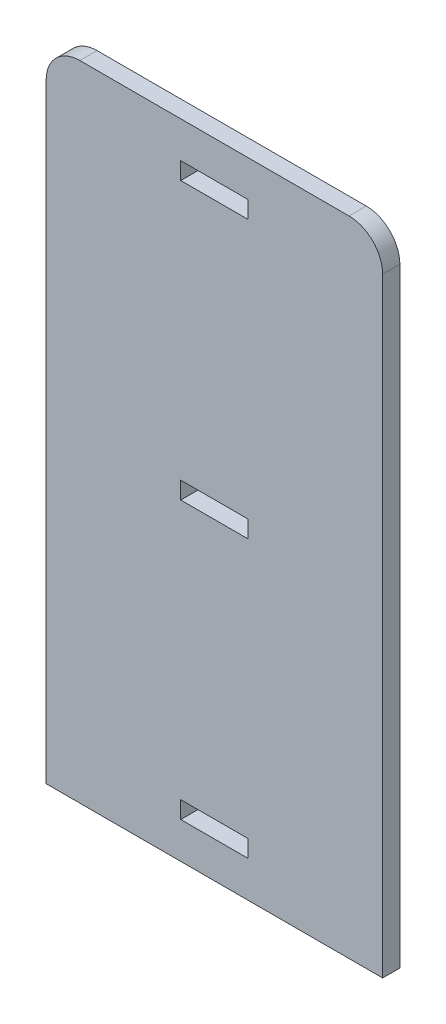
ISO-10303-21;
HEADER;
FILE_DESCRIPTION(('STEP AP214'),'2;1');
FILE_NAME('part.step','',(''),(''),'','','');
FILE_SCHEMA(('AUTOMOTIVE_DESIGN { 1 0 10303 214 1 1 1 1 }'));
ENDSEC;
DATA;
#1=APPLICATION_CONTEXT('core data for automotive mechanical design processes');
#2=APPLICATION_PROTOCOL_DEFINITION('international standard','automotive_design',2000,#1);
#3=PRODUCT_CONTEXT('',#1,'mechanical');
#4=PRODUCT('Part','Part','',(#3));
#5=PRODUCT_RELATED_PRODUCT_CATEGORY('part','',(#4));
#6=PRODUCT_DEFINITION_FORMATION('','',#4);
#7=PRODUCT_DEFINITION_CONTEXT('part definition',#1,'design');
#8=PRODUCT_DEFINITION('design','',#6,#7);
#9=PRODUCT_DEFINITION_SHAPE('','',#8);
#10=(LENGTH_UNIT() NAMED_UNIT(*) SI_UNIT(.MILLI.,.METRE.));
#11=(NAMED_UNIT(*) PLANE_ANGLE_UNIT() SI_UNIT($,.RADIAN.));
#12=(NAMED_UNIT(*) SI_UNIT($,.STERADIAN.) SOLID_ANGLE_UNIT());
#13=UNCERTAINTY_MEASURE_WITH_UNIT(LENGTH_MEASURE(1.E-05),#10,'distance_accuracy_value','');
#14=(GEOMETRIC_REPRESENTATION_CONTEXT(3) GLOBAL_UNCERTAINTY_ASSIGNED_CONTEXT((#13)) GLOBAL_UNIT_ASSIGNED_CONTEXT((#10,
#11,#12)) REPRESENTATION_CONTEXT('',''));
#15=CARTESIAN_POINT('',(0.,0.,0.));
#16=DIRECTION('',(0.,0.,1.));
#17=DIRECTION('',(1.,0.,0.));
#18=AXIS2_PLACEMENT_3D('',#15,#16,#17);
#19=CARTESIAN_POINT('',(0.,233.038781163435,23.));
#20=DIRECTION('',(0.,-1.,0.));
#21=DIRECTION('',(1.,0.,0.));
#22=AXIS2_PLACEMENT_3D('',#19,#20,#21);
#23=PLANE('',#22);
#24=DIRECTION('',(-1.,0.,0.));
#25=VECTOR('',#24,1.);
#26=CARTESIAN_POINT('',(0.,233.038781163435,0.));
#27=LINE('',#26,#25);
#28=CARTESIAN_POINT('',(180.417337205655,233.038781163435,0.));
#29=VERTEX_POINT('',#28);
#30=CARTESIAN_POINT('',(-179.582662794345,233.038781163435,0.));
#31=VERTEX_POINT('',#30);
#32=EDGE_CURVE('E222',#29,#31,#27,.T.);
#33=ORIENTED_EDGE('',*,*,#32,.T.);
#34=DIRECTION('',(0.,0.,-1.));
#35=VECTOR('',#34,1.);
#36=CARTESIAN_POINT('',(-179.582662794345,233.038781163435,23.));
#37=LINE('',#36,#35);
#38=CARTESIAN_POINT('',(-179.582662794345,233.038781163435,23.));
#39=VERTEX_POINT('',#38);
#40=EDGE_CURVE('E11',#39,#31,#37,.T.);
#41=ORIENTED_EDGE('',*,*,#40,.F.);
#42=DIRECTION('',(-1.,0.,0.));
#43=VECTOR('',#42,1.);
#44=CARTESIAN_POINT('',(0.,233.038781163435,23.));
#45=LINE('',#44,#43);
#46=CARTESIAN_POINT('',(180.417337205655,233.038781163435,23.));
#47=VERTEX_POINT('',#46);
#48=EDGE_CURVE('E312',#47,#39,#45,.T.);
#49=ORIENTED_EDGE('',*,*,#48,.F.);
#50=DIRECTION('',(0.,0.,-1.));
#51=VECTOR('',#50,1.);
#52=CARTESIAN_POINT('',(180.417337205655,233.038781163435,23.));
#53=LINE('',#52,#51);
#54=EDGE_CURVE('E233',#47,#29,#53,.T.);
#55=ORIENTED_EDGE('',*,*,#54,.T.);
#56=EDGE_LOOP('',(#33,#41,#49,#55));
#57=FACE_BOUND('',#56,.T.);
#58=ADVANCED_FACE('F34',(#57),#23,.F.);
#59=CARTESIAN_POINT('',(-179.582662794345,188.038781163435,23.));
#60=DIRECTION('',(0.,0.,-1.));
#61=DIRECTION('',(-1.,0.,0.));
#62=AXIS2_PLACEMENT_3D('',#59,#60,#61);
#63=CYLINDRICAL_SURFACE('',#62,45.);
#64=CARTESIAN_POINT('',(-179.582662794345,188.038781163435,0.));
#65=DIRECTION('',(0.,0.,1.));
#66=DIRECTION('',(1.,0.,0.));
#67=AXIS2_PLACEMENT_3D('',#64,#65,#66);
#68=CIRCLE('',#67,45.);
#69=CARTESIAN_POINT('',(-224.582662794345,188.038781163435,0.));
#70=VERTEX_POINT('',#69);
#71=EDGE_CURVE('E225',#31,#70,#68,.T.);
#72=ORIENTED_EDGE('',*,*,#71,.T.);
#73=DIRECTION('',(0.,0.,-1.));
#74=VECTOR('',#73,1.);
#75=CARTESIAN_POINT('',(-224.582662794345,188.038781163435,23.));
#76=LINE('',#75,#74);
#77=CARTESIAN_POINT('',(-224.582662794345,188.038781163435,23.));
#78=VERTEX_POINT('',#77);
#79=EDGE_CURVE('E44',#78,#70,#76,.T.);
#80=ORIENTED_EDGE('',*,*,#79,.F.);
#81=CARTESIAN_POINT('',(-179.582662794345,188.038781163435,23.));
#82=DIRECTION('',(0.,0.,1.));
#83=DIRECTION('',(1.,0.,0.));
#84=AXIS2_PLACEMENT_3D('',#81,#82,#83);
#85=CIRCLE('',#84,45.);
#86=EDGE_CURVE('E314',#39,#78,#85,.T.);
#87=ORIENTED_EDGE('',*,*,#86,.F.);
#88=ORIENTED_EDGE('',*,*,#40,.T.);
#89=EDGE_LOOP('',(#72,#80,#87,#88));
#90=FACE_BOUND('',#89,.T.);
#91=ADVANCED_FACE('F319',(#90),#63,.T.);
#92=CARTESIAN_POINT('',(-224.582662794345,0.,23.));
#93=DIRECTION('',(1.,0.,0.));
#94=DIRECTION('',(0.,1.,0.));
#95=AXIS2_PLACEMENT_3D('',#92,#93,#94);
#96=PLANE('',#95);
#97=DIRECTION('',(0.,-1.,0.));
#98=VECTOR('',#97,1.);
#99=CARTESIAN_POINT('',(-224.582662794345,0.,0.));
#100=LINE('',#99,#98);
#101=CARTESIAN_POINT('',(-224.582662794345,-626.961218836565,0.));
#102=VERTEX_POINT('',#101);
#103=EDGE_CURVE('E227',#70,#102,#100,.T.);
#104=ORIENTED_EDGE('',*,*,#103,.T.);
#105=DIRECTION('',(0.,0.,-1.));
#106=VECTOR('',#105,1.);
#107=CARTESIAN_POINT('',(-224.582662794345,-626.961218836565,23.));
#108=LINE('',#107,#106);
#109=CARTESIAN_POINT('',(-224.582662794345,-626.961218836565,23.));
#110=VERTEX_POINT('',#109);
#111=EDGE_CURVE('E186',#110,#102,#108,.T.);
#112=ORIENTED_EDGE('',*,*,#111,.F.);
#113=DIRECTION('',(0.,-1.,0.));
#114=VECTOR('',#113,1.);
#115=CARTESIAN_POINT('',(-224.582662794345,0.,23.));
#116=LINE('',#115,#114);
#117=EDGE_CURVE('E177',#78,#110,#116,.T.);
#118=ORIENTED_EDGE('',*,*,#117,.F.);
#119=ORIENTED_EDGE('',*,*,#79,.T.);
#120=EDGE_LOOP('',(#104,#112,#118,#119));
#121=FACE_BOUND('',#120,.T.);
#122=ADVANCED_FACE('F322',(#121),#96,.F.);
#123=CARTESIAN_POINT('',(0.,-626.961218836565,23.));
#124=DIRECTION('',(0.,1.,0.));
#125=DIRECTION('',(0.,0.,1.));
#126=AXIS2_PLACEMENT_3D('',#123,#124,#125);
#127=PLANE('',#126);
#128=DIRECTION('',(1.,0.,0.));
#129=VECTOR('',#128,1.);
#130=CARTESIAN_POINT('',(0.,-626.961218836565,0.));
#131=LINE('',#130,#129);
#132=CARTESIAN_POINT('',(225.417337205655,-626.961218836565,0.));
#133=VERTEX_POINT('',#132);
#134=EDGE_CURVE('E185',#102,#133,#131,.T.);
#135=ORIENTED_EDGE('',*,*,#134,.T.);
#136=DIRECTION('',(0.,0.,-1.));
#137=VECTOR('',#136,1.);
#138=CARTESIAN_POINT('',(225.417337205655,-626.961218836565,23.));
#139=LINE('',#138,#137);
#140=CARTESIAN_POINT('',(225.417337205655,-626.961218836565,23.));
#141=VERTEX_POINT('',#140);
#142=EDGE_CURVE('E182',#141,#133,#139,.T.);
#143=ORIENTED_EDGE('',*,*,#142,.F.);
#144=DIRECTION('',(1.,0.,0.));
#145=VECTOR('',#144,1.);
#146=CARTESIAN_POINT('',(0.,-626.961218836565,23.));
#147=LINE('',#146,#145);
#148=EDGE_CURVE('E171',#110,#141,#147,.T.);
#149=ORIENTED_EDGE('',*,*,#148,.F.);
#150=ORIENTED_EDGE('',*,*,#111,.T.);
#151=EDGE_LOOP('',(#135,#143,#149,#150));
#152=FACE_BOUND('',#151,.T.);
#153=ADVANCED_FACE('F183',(#152),#127,.F.);
#154=CARTESIAN_POINT('',(225.417337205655,0.,23.));
#155=DIRECTION('',(-1.,0.,0.));
#156=DIRECTION('',(0.,-1.,0.));
#157=AXIS2_PLACEMENT_3D('',#154,#155,#156);
#158=PLANE('',#157);
#159=DIRECTION('',(0.,1.,0.));
#160=VECTOR('',#159,1.);
#161=CARTESIAN_POINT('',(225.417337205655,0.,0.));
#162=LINE('',#161,#160);
#163=CARTESIAN_POINT('',(225.417337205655,188.038781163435,0.));
#164=VERTEX_POINT('',#163);
#165=EDGE_CURVE('E112',#133,#164,#162,.T.);
#166=ORIENTED_EDGE('',*,*,#165,.T.);
#167=DIRECTION('',(0.,0.,-1.));
#168=VECTOR('',#167,1.);
#169=CARTESIAN_POINT('',(225.417337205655,188.038781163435,23.));
#170=LINE('',#169,#168);
#171=CARTESIAN_POINT('',(225.417337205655,188.038781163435,23.));
#172=VERTEX_POINT('',#171);
#173=EDGE_CURVE('E187',#172,#164,#170,.T.);
#174=ORIENTED_EDGE('',*,*,#173,.F.);
#175=DIRECTION('',(0.,1.,0.));
#176=VECTOR('',#175,1.);
#177=CARTESIAN_POINT('',(225.417337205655,0.,23.));
#178=LINE('',#177,#176);
#179=EDGE_CURVE('E175',#141,#172,#178,.T.);
#180=ORIENTED_EDGE('',*,*,#179,.F.);
#181=ORIENTED_EDGE('',*,*,#142,.T.);
#182=EDGE_LOOP('',(#166,#174,#180,#181));
#183=FACE_BOUND('',#182,.T.);
#184=ADVANCED_FACE('F189',(#183),#158,.F.);
#185=CARTESIAN_POINT('',(45.4173372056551,0.,23.));
#186=DIRECTION('',(1.,0.,0.));
#187=DIRECTION('',(0.,0.,-1.));
#188=AXIS2_PLACEMENT_3D('',#185,#186,#187);
#189=PLANE('',#188);
#190=DIRECTION('',(0.,-1.,0.));
#191=VECTOR('',#190,1.);
#192=CARTESIAN_POINT('',(45.4173372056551,0.,0.));
#193=LINE('',#192,#191);
#194=CARTESIAN_POINT('',(45.4173372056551,184.538781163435,0.));
#195=VERTEX_POINT('',#194);
#196=CARTESIAN_POINT('',(45.4173372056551,161.538781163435,0.));
#197=VERTEX_POINT('',#196);
#198=EDGE_CURVE('E213',#195,#197,#193,.T.);
#199=ORIENTED_EDGE('',*,*,#198,.T.);
#200=DIRECTION('',(0.,0.,-1.));
#201=VECTOR('',#200,1.);
#202=CARTESIAN_POINT('',(45.4173372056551,161.538781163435,23.));
#203=LINE('',#202,#201);
#204=CARTESIAN_POINT('',(45.4173372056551,161.538781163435,23.));
#205=VERTEX_POINT('',#204);
#206=EDGE_CURVE('E235',#205,#197,#203,.T.);
#207=ORIENTED_EDGE('',*,*,#206,.F.);
#208=DIRECTION('',(0.,-1.,0.));
#209=VECTOR('',#208,1.);
#210=CARTESIAN_POINT('',(45.4173372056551,0.,23.));
#211=LINE('',#210,#209);
#212=CARTESIAN_POINT('',(45.4173372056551,184.538781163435,23.));
#213=VERTEX_POINT('',#212);
#214=EDGE_CURVE('E303',#213,#205,#211,.T.);
#215=ORIENTED_EDGE('',*,*,#214,.F.);
#216=DIRECTION('',(0.,0.,-1.));
#217=VECTOR('',#216,1.);
#218=CARTESIAN_POINT('',(45.4173372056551,184.538781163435,23.));
#219=LINE('',#218,#217);
#220=EDGE_CURVE('E240',#213,#195,#219,.T.);
#221=ORIENTED_EDGE('',*,*,#220,.T.);
#222=EDGE_LOOP('',(#199,#207,#215,#221));
#223=FACE_BOUND('',#222,.T.);
#224=ADVANCED_FACE('F358',(#223),#189,.F.);
#225=CARTESIAN_POINT('',(0.,161.538781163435,23.));
#226=DIRECTION('',(0.,-1.,0.));
#227=DIRECTION('',(0.,0.,-1.));
#228=AXIS2_PLACEMENT_3D('',#225,#226,#227);
#229=PLANE('',#228);
#230=DIRECTION('',(-1.,0.,0.));
#231=VECTOR('',#230,1.);
#232=CARTESIAN_POINT('',(0.,161.538781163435,0.));
#233=LINE('',#232,#231);
#234=CARTESIAN_POINT('',(-44.5826627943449,161.538781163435,0.));
#235=VERTEX_POINT('',#234);
#236=EDGE_CURVE('E216',#197,#235,#233,.T.);
#237=ORIENTED_EDGE('',*,*,#236,.T.);
#238=DIRECTION('',(0.,0.,-1.));
#239=VECTOR('',#238,1.);
#240=CARTESIAN_POINT('',(-44.5826627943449,161.538781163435,23.));
#241=LINE('',#240,#239);
#242=CARTESIAN_POINT('',(-44.5826627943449,161.538781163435,23.));
#243=VERTEX_POINT('',#242);
#244=EDGE_CURVE('E247',#243,#235,#241,.T.);
#245=ORIENTED_EDGE('',*,*,#244,.F.);
#246=DIRECTION('',(-1.,0.,0.));
#247=VECTOR('',#246,1.);
#248=CARTESIAN_POINT('',(0.,161.538781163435,23.));
#249=LINE('',#248,#247);
#250=EDGE_CURVE('E306',#205,#243,#249,.T.);
#251=ORIENTED_EDGE('',*,*,#250,.F.);
#252=ORIENTED_EDGE('',*,*,#206,.T.);
#253=EDGE_LOOP('',(#237,#245,#251,#252));
#254=FACE_BOUND('',#253,.T.);
#255=ADVANCED_FACE('F354',(#254),#229,.F.);
#256=CARTESIAN_POINT('',(-44.5826627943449,0.,23.));
#257=DIRECTION('',(-1.,0.,0.));
#258=DIRECTION('',(0.,0.,1.));
#259=AXIS2_PLACEMENT_3D('',#256,#257,#258);
#260=PLANE('',#259);
#261=DIRECTION('',(0.,1.,0.));
#262=VECTOR('',#261,1.);
#263=CARTESIAN_POINT('',(-44.5826627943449,0.,0.));
#264=LINE('',#263,#262);
#265=CARTESIAN_POINT('',(-44.5826627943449,184.538781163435,0.));
#266=VERTEX_POINT('',#265);
#267=EDGE_CURVE('E218',#235,#266,#264,.T.);
#268=ORIENTED_EDGE('',*,*,#267,.T.);
#269=DIRECTION('',(0.,0.,-1.));
#270=VECTOR('',#269,1.);
#271=CARTESIAN_POINT('',(-44.5826627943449,184.538781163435,23.));
#272=LINE('',#271,#270);
#273=CARTESIAN_POINT('',(-44.5826627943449,184.538781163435,23.));
#274=VERTEX_POINT('',#273);
#275=EDGE_CURVE('E243',#274,#266,#272,.T.);
#276=ORIENTED_EDGE('',*,*,#275,.F.);
#277=DIRECTION('',(0.,1.,0.));
#278=VECTOR('',#277,1.);
#279=CARTESIAN_POINT('',(-44.5826627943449,0.,23.));
#280=LINE('',#279,#278);
#281=EDGE_CURVE('E308',#243,#274,#280,.T.);
#282=ORIENTED_EDGE('',*,*,#281,.F.);
#283=ORIENTED_EDGE('',*,*,#244,.T.);
#284=EDGE_LOOP('',(#268,#276,#282,#283));
#285=FACE_BOUND('',#284,.T.);
#286=ADVANCED_FACE('F350',(#285),#260,.F.);
#287=CARTESIAN_POINT('',(45.4173372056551,0.,23.));
#288=DIRECTION('',(1.,0.,0.));
#289=DIRECTION('',(0.,0.,-1.));
#290=AXIS2_PLACEMENT_3D('',#287,#288,#289);
#291=PLANE('',#290);
#292=DIRECTION('',(0.,-1.,0.));
#293=VECTOR('',#292,1.);
#294=CARTESIAN_POINT('',(45.4173372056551,0.,0.));
#295=LINE('',#294,#293);
#296=CARTESIAN_POINT('',(45.4173372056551,-185.461218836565,0.));
#297=VERTEX_POINT('',#296);
#298=CARTESIAN_POINT('',(45.4173372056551,-208.461218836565,0.));
#299=VERTEX_POINT('',#298);
#300=EDGE_CURVE('E204',#297,#299,#295,.T.);
#301=ORIENTED_EDGE('',*,*,#300,.T.);
#302=DIRECTION('',(0.,0.,-1.));
#303=VECTOR('',#302,1.);
#304=CARTESIAN_POINT('',(45.4173372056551,-208.461218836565,23.));
#305=LINE('',#304,#303);
#306=CARTESIAN_POINT('',(45.4173372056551,-208.461218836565,23.));
#307=VERTEX_POINT('',#306);
#308=EDGE_CURVE('E244',#307,#299,#305,.T.);
#309=ORIENTED_EDGE('',*,*,#308,.F.);
#310=DIRECTION('',(0.,-1.,0.));
#311=VECTOR('',#310,1.);
#312=CARTESIAN_POINT('',(45.4173372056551,0.,23.));
#313=LINE('',#312,#311);
#314=CARTESIAN_POINT('',(45.4173372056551,-185.461218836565,23.));
#315=VERTEX_POINT('',#314);
#316=EDGE_CURVE('E289',#315,#307,#313,.T.);
#317=ORIENTED_EDGE('',*,*,#316,.F.);
#318=DIRECTION('',(0.,0.,-1.));
#319=VECTOR('',#318,1.);
#320=CARTESIAN_POINT('',(45.4173372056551,-185.461218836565,23.));
#321=LINE('',#320,#319);
#322=EDGE_CURVE('E252',#315,#297,#321,.T.);
#323=ORIENTED_EDGE('',*,*,#322,.T.);
#324=EDGE_LOOP('',(#301,#309,#317,#323));
#325=FACE_BOUND('',#324,.T.);
#326=ADVANCED_FACE('F353',(#325),#291,.F.);
#327=CARTESIAN_POINT('',(0.,-208.461218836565,23.));
#328=DIRECTION('',(0.,-1.,0.));
#329=DIRECTION('',(0.,0.,-1.));
#330=AXIS2_PLACEMENT_3D('',#327,#328,#329);
#331=PLANE('',#330);
#332=DIRECTION('',(-1.,0.,0.));
#333=VECTOR('',#332,1.);
#334=CARTESIAN_POINT('',(0.,-208.461218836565,0.));
#335=LINE('',#334,#333);
#336=CARTESIAN_POINT('',(-44.5826627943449,-208.461218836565,0.));
#337=VERTEX_POINT('',#336);
#338=EDGE_CURVE('E207',#299,#337,#335,.T.);
#339=ORIENTED_EDGE('',*,*,#338,.T.);
#340=DIRECTION('',(0.,0.,-1.));
#341=VECTOR('',#340,1.);
#342=CARTESIAN_POINT('',(-44.5826627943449,-208.461218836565,23.));
#343=LINE('',#342,#341);
#344=CARTESIAN_POINT('',(-44.5826627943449,-208.461218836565,23.));
#345=VERTEX_POINT('',#344);
#346=EDGE_CURVE('E258',#345,#337,#343,.T.);
#347=ORIENTED_EDGE('',*,*,#346,.F.);
#348=DIRECTION('',(-1.,0.,0.));
#349=VECTOR('',#348,1.);
#350=CARTESIAN_POINT('',(0.,-208.461218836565,23.));
#351=LINE('',#350,#349);
#352=EDGE_CURVE('E293',#307,#345,#351,.T.);
#353=ORIENTED_EDGE('',*,*,#352,.F.);
#354=ORIENTED_EDGE('',*,*,#308,.T.);
#355=EDGE_LOOP('',(#339,#347,#353,#354));
#356=FACE_BOUND('',#355,.T.);
#357=ADVANCED_FACE('F369',(#356),#331,.F.);
#358=CARTESIAN_POINT('',(-44.5826627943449,0.,23.));
#359=DIRECTION('',(-1.,0.,0.));
#360=DIRECTION('',(0.,0.,1.));
#361=AXIS2_PLACEMENT_3D('',#358,#359,#360);
#362=PLANE('',#361);
#363=DIRECTION('',(0.,1.,0.));
#364=VECTOR('',#363,1.);
#365=CARTESIAN_POINT('',(-44.5826627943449,0.,0.));
#366=LINE('',#365,#364);
#367=CARTESIAN_POINT('',(-44.5826627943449,-185.461218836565,0.));
#368=VERTEX_POINT('',#367);
#369=EDGE_CURVE('E209',#337,#368,#366,.T.);
#370=ORIENTED_EDGE('',*,*,#369,.T.);
#371=DIRECTION('',(0.,0.,-1.));
#372=VECTOR('',#371,1.);
#373=CARTESIAN_POINT('',(-44.5826627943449,-185.461218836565,23.));
#374=LINE('',#373,#372);
#375=CARTESIAN_POINT('',(-44.5826627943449,-185.461218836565,23.));
#376=VERTEX_POINT('',#375);
#377=EDGE_CURVE('E255',#376,#368,#374,.T.);
#378=ORIENTED_EDGE('',*,*,#377,.F.);
#379=DIRECTION('',(0.,1.,0.));
#380=VECTOR('',#379,1.);
#381=CARTESIAN_POINT('',(-44.5826627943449,0.,23.));
#382=LINE('',#381,#380);
#383=EDGE_CURVE('E299',#345,#376,#382,.T.);
#384=ORIENTED_EDGE('',*,*,#383,.F.);
#385=ORIENTED_EDGE('',*,*,#346,.T.);
#386=EDGE_LOOP('',(#370,#378,#384,#385));
#387=FACE_BOUND('',#386,.T.);
#388=ADVANCED_FACE('F366',(#387),#362,.F.);
#389=CARTESIAN_POINT('',(45.4173372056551,0.,23.));
#390=DIRECTION('',(1.,0.,0.));
#391=DIRECTION('',(0.,0.,-1.));
#392=AXIS2_PLACEMENT_3D('',#389,#390,#391);
#393=PLANE('',#392);
#394=DIRECTION('',(0.,-1.,0.));
#395=VECTOR('',#394,1.);
#396=CARTESIAN_POINT('',(45.4173372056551,0.,0.));
#397=LINE('',#396,#395);
#398=CARTESIAN_POINT('',(45.4173372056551,-555.461218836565,0.));
#399=VERTEX_POINT('',#398);
#400=CARTESIAN_POINT('',(45.4173372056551,-578.461218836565,0.));
#401=VERTEX_POINT('',#400);
#402=EDGE_CURVE('E195',#399,#401,#397,.T.);
#403=ORIENTED_EDGE('',*,*,#402,.T.);
#404=DIRECTION('',(0.,0.,-1.));
#405=VECTOR('',#404,1.);
#406=CARTESIAN_POINT('',(45.4173372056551,-578.461218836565,23.));
#407=LINE('',#406,#405);
#408=CARTESIAN_POINT('',(45.4173372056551,-578.461218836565,23.));
#409=VERTEX_POINT('',#408);
#410=EDGE_CURVE('E38',#409,#401,#407,.T.);
#411=ORIENTED_EDGE('',*,*,#410,.F.);
#412=DIRECTION('',(0.,-1.,0.));
#413=VECTOR('',#412,1.);
#414=CARTESIAN_POINT('',(45.4173372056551,0.,23.));
#415=LINE('',#414,#413);
#416=CARTESIAN_POINT('',(45.4173372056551,-555.461218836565,23.));
#417=VERTEX_POINT('',#416);
#418=EDGE_CURVE('E232',#417,#409,#415,.T.);
#419=ORIENTED_EDGE('',*,*,#418,.F.);
#420=DIRECTION('',(0.,0.,-1.));
#421=VECTOR('',#420,1.);
#422=CARTESIAN_POINT('',(45.4173372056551,-555.461218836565,23.));
#423=LINE('',#422,#421);
#424=EDGE_CURVE('E191',#417,#399,#423,.T.);
#425=ORIENTED_EDGE('',*,*,#424,.T.);
#426=EDGE_LOOP('',(#403,#411,#419,#425));
#427=FACE_BOUND('',#426,.T.);
#428=ADVANCED_FACE('F36',(#427),#393,.F.);
#429=CARTESIAN_POINT('',(0.,-578.461218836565,23.));
#430=DIRECTION('',(0.,-1.,0.));
#431=DIRECTION('',(0.,0.,-1.));
#432=AXIS2_PLACEMENT_3D('',#429,#430,#431);
#433=PLANE('',#432);
#434=DIRECTION('',(-1.,0.,0.));
#435=VECTOR('',#434,1.);
#436=CARTESIAN_POINT('',(0.,-578.461218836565,0.));
#437=LINE('',#436,#435);
#438=CARTESIAN_POINT('',(-44.5826627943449,-578.461218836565,0.));
#439=VERTEX_POINT('',#438);
#440=EDGE_CURVE('E198',#401,#439,#437,.T.);
#441=ORIENTED_EDGE('',*,*,#440,.T.);
#442=DIRECTION('',(0.,0.,-1.));
#443=VECTOR('',#442,1.);
#444=CARTESIAN_POINT('',(-44.5826627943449,-578.461218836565,23.));
#445=LINE('',#444,#443);
#446=CARTESIAN_POINT('',(-44.5826627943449,-578.461218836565,23.));
#447=VERTEX_POINT('',#446);
#448=EDGE_CURVE('E267',#447,#439,#445,.T.);
#449=ORIENTED_EDGE('',*,*,#448,.F.);
#450=DIRECTION('',(-1.,0.,0.));
#451=VECTOR('',#450,1.);
#452=CARTESIAN_POINT('',(0.,-578.461218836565,23.));
#453=LINE('',#452,#451);
#454=EDGE_CURVE('E127',#409,#447,#453,.T.);
#455=ORIENTED_EDGE('',*,*,#454,.F.);
#456=ORIENTED_EDGE('',*,*,#410,.T.);
#457=EDGE_LOOP('',(#441,#449,#455,#456));
#458=FACE_BOUND('',#457,.T.);
#459=ADVANCED_FACE('F273',(#458),#433,.F.);
#460=CARTESIAN_POINT('',(-44.5826627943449,0.,23.));
#461=DIRECTION('',(-1.,0.,0.));
#462=DIRECTION('',(0.,0.,1.));
#463=AXIS2_PLACEMENT_3D('',#460,#461,#462);
#464=PLANE('',#463);
#465=DIRECTION('',(0.,1.,0.));
#466=VECTOR('',#465,1.);
#467=CARTESIAN_POINT('',(-44.5826627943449,0.,0.));
#468=LINE('',#467,#466);
#469=CARTESIAN_POINT('',(-44.5826627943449,-555.461218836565,0.));
#470=VERTEX_POINT('',#469);
#471=EDGE_CURVE('E200',#439,#470,#468,.T.);
#472=ORIENTED_EDGE('',*,*,#471,.T.);
#473=DIRECTION('',(0.,0.,-1.));
#474=VECTOR('',#473,1.);
#475=CARTESIAN_POINT('',(-44.5826627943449,-555.461218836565,23.));
#476=LINE('',#475,#474);
#477=CARTESIAN_POINT('',(-44.5826627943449,-555.461218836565,23.));
#478=VERTEX_POINT('',#477);
#479=EDGE_CURVE('E265',#478,#470,#476,.T.);
#480=ORIENTED_EDGE('',*,*,#479,.F.);
#481=DIRECTION('',(0.,1.,0.));
#482=VECTOR('',#481,1.);
#483=CARTESIAN_POINT('',(-44.5826627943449,0.,23.));
#484=LINE('',#483,#482);
#485=EDGE_CURVE('E290',#447,#478,#484,.T.);
#486=ORIENTED_EDGE('',*,*,#485,.F.);
#487=ORIENTED_EDGE('',*,*,#448,.T.);
#488=EDGE_LOOP('',(#472,#480,#486,#487));
#489=FACE_BOUND('',#488,.T.);
#490=ADVANCED_FACE('F283',(#489),#464,.F.);
#491=CARTESIAN_POINT('',(0.,184.538781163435,23.));
#492=DIRECTION('',(0.,1.,0.));
#493=DIRECTION('',(0.,0.,1.));
#494=AXIS2_PLACEMENT_3D('',#491,#492,#493);
#495=PLANE('',#494);
#496=DIRECTION('',(1.,0.,0.));
#497=VECTOR('',#496,1.);
#498=CARTESIAN_POINT('',(0.,184.538781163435,0.));
#499=LINE('',#498,#497);
#500=EDGE_CURVE('E220',#266,#195,#499,.T.);
#501=ORIENTED_EDGE('',*,*,#500,.T.);
#502=ORIENTED_EDGE('',*,*,#220,.F.);
#503=DIRECTION('',(1.,0.,0.));
#504=VECTOR('',#503,1.);
#505=CARTESIAN_POINT('',(0.,184.538781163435,23.));
#506=LINE('',#505,#504);
#507=EDGE_CURVE('E310',#274,#213,#506,.T.);
#508=ORIENTED_EDGE('',*,*,#507,.F.);
#509=ORIENTED_EDGE('',*,*,#275,.T.);
#510=EDGE_LOOP('',(#501,#502,#508,#509));
#511=FACE_BOUND('',#510,.T.);
#512=ADVANCED_FACE('F346',(#511),#495,.F.);
#513=CARTESIAN_POINT('',(0.,-185.461218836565,23.));
#514=DIRECTION('',(0.,1.,0.));
#515=DIRECTION('',(0.,0.,1.));
#516=AXIS2_PLACEMENT_3D('',#513,#514,#515);
#517=PLANE('',#516);
#518=DIRECTION('',(1.,0.,0.));
#519=VECTOR('',#518,1.);
#520=CARTESIAN_POINT('',(0.,-185.461218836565,0.));
#521=LINE('',#520,#519);
#522=EDGE_CURVE('E211',#368,#297,#521,.T.);
#523=ORIENTED_EDGE('',*,*,#522,.T.);
#524=ORIENTED_EDGE('',*,*,#322,.F.);
#525=DIRECTION('',(1.,0.,0.));
#526=VECTOR('',#525,1.);
#527=CARTESIAN_POINT('',(0.,-185.461218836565,23.));
#528=LINE('',#527,#526);
#529=EDGE_CURVE('E301',#376,#315,#528,.T.);
#530=ORIENTED_EDGE('',*,*,#529,.F.);
#531=ORIENTED_EDGE('',*,*,#377,.T.);
#532=EDGE_LOOP('',(#523,#524,#530,#531));
#533=FACE_BOUND('',#532,.T.);
#534=ADVANCED_FACE('F334',(#533),#517,.F.);
#535=CARTESIAN_POINT('',(0.,-555.461218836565,23.));
#536=DIRECTION('',(0.,1.,0.));
#537=DIRECTION('',(0.,0.,1.));
#538=AXIS2_PLACEMENT_3D('',#535,#536,#537);
#539=PLANE('',#538);
#540=DIRECTION('',(1.,0.,0.));
#541=VECTOR('',#540,1.);
#542=CARTESIAN_POINT('',(0.,-555.461218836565,0.));
#543=LINE('',#542,#541);
#544=EDGE_CURVE('E202',#470,#399,#543,.T.);
#545=ORIENTED_EDGE('',*,*,#544,.T.);
#546=ORIENTED_EDGE('',*,*,#424,.F.);
#547=DIRECTION('',(1.,0.,0.));
#548=VECTOR('',#547,1.);
#549=CARTESIAN_POINT('',(0.,-555.461218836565,23.));
#550=LINE('',#549,#548);
#551=EDGE_CURVE('E287',#478,#417,#550,.T.);
#552=ORIENTED_EDGE('',*,*,#551,.F.);
#553=ORIENTED_EDGE('',*,*,#479,.T.);
#554=EDGE_LOOP('',(#545,#546,#552,#553));
#555=FACE_BOUND('',#554,.T.);
#556=ADVANCED_FACE('F286',(#555),#539,.F.);
#557=CARTESIAN_POINT('',(180.417337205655,188.038781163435,23.));
#558=DIRECTION('',(0.,0.,-1.));
#559=DIRECTION('',(-1.,0.,0.));
#560=AXIS2_PLACEMENT_3D('',#557,#558,#559);
#561=CYLINDRICAL_SURFACE('',#560,45.);
#562=CARTESIAN_POINT('',(180.417337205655,188.038781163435,0.));
#563=DIRECTION('',(0.,0.,1.));
#564=DIRECTION('',(1.,0.,0.));
#565=AXIS2_PLACEMENT_3D('',#562,#563,#564);
#566=CIRCLE('',#565,45.);
#567=EDGE_CURVE('E118',#164,#29,#566,.T.);
#568=ORIENTED_EDGE('',*,*,#567,.T.);
#569=ORIENTED_EDGE('',*,*,#54,.F.);
#570=CARTESIAN_POINT('',(180.417337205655,188.038781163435,23.));
#571=DIRECTION('',(0.,0.,1.));
#572=DIRECTION('',(1.,0.,0.));
#573=AXIS2_PLACEMENT_3D('',#570,#571,#572);
#574=CIRCLE('',#573,45.);
#575=EDGE_CURVE('E53',#172,#47,#574,.T.);
#576=ORIENTED_EDGE('',*,*,#575,.F.);
#577=ORIENTED_EDGE('',*,*,#173,.T.);
#578=EDGE_LOOP('',(#568,#569,#576,#577));
#579=FACE_BOUND('',#578,.T.);
#580=ADVANCED_FACE('F326',(#579),#561,.T.);
#581=CARTESIAN_POINT('',(0.,0.,23.));
#582=DIRECTION('',(0.,0.,1.));
#583=DIRECTION('',(1.,0.,0.));
#584=AXIS2_PLACEMENT_3D('',#581,#582,#583);
#585=PLANE('',#584);
#586=ORIENTED_EDGE('',*,*,#418,.T.);
#587=ORIENTED_EDGE('',*,*,#454,.T.);
#588=ORIENTED_EDGE('',*,*,#485,.T.);
#589=ORIENTED_EDGE('',*,*,#551,.T.);
#590=EDGE_LOOP('',(#586,#587,#588,#589));
#591=FACE_BOUND('',#590,.T.);
#592=ORIENTED_EDGE('',*,*,#316,.T.);
#593=ORIENTED_EDGE('',*,*,#352,.T.);
#594=ORIENTED_EDGE('',*,*,#383,.T.);
#595=ORIENTED_EDGE('',*,*,#529,.T.);
#596=EDGE_LOOP('',(#592,#593,#594,#595));
#597=FACE_BOUND('',#596,.T.);
#598=ORIENTED_EDGE('',*,*,#214,.T.);
#599=ORIENTED_EDGE('',*,*,#250,.T.);
#600=ORIENTED_EDGE('',*,*,#281,.T.);
#601=ORIENTED_EDGE('',*,*,#507,.T.);
#602=EDGE_LOOP('',(#598,#599,#600,#601));
#603=FACE_BOUND('',#602,.T.);
#604=ORIENTED_EDGE('',*,*,#48,.T.);
#605=ORIENTED_EDGE('',*,*,#86,.T.);
#606=ORIENTED_EDGE('',*,*,#117,.T.);
#607=ORIENTED_EDGE('',*,*,#148,.T.);
#608=ORIENTED_EDGE('',*,*,#179,.T.);
#609=ORIENTED_EDGE('',*,*,#575,.T.);
#610=EDGE_LOOP('',(#604,#605,#606,#607,#608,#609));
#611=FACE_BOUND('',#610,.T.);
#612=ADVANCED_FACE('F173',(#591,#597,#603,#611),#585,.T.);
#613=CARTESIAN_POINT('',(0.,0.,0.));
#614=DIRECTION('',(0.,0.,1.));
#615=DIRECTION('',(1.,0.,0.));
#616=AXIS2_PLACEMENT_3D('',#613,#614,#615);
#617=PLANE('',#616);
#618=ORIENTED_EDGE('',*,*,#402,.F.);
#619=ORIENTED_EDGE('',*,*,#544,.F.);
#620=ORIENTED_EDGE('',*,*,#471,.F.);
#621=ORIENTED_EDGE('',*,*,#440,.F.);
#622=EDGE_LOOP('',(#618,#619,#620,#621));
#623=FACE_BOUND('',#622,.T.);
#624=ORIENTED_EDGE('',*,*,#300,.F.);
#625=ORIENTED_EDGE('',*,*,#522,.F.);
#626=ORIENTED_EDGE('',*,*,#369,.F.);
#627=ORIENTED_EDGE('',*,*,#338,.F.);
#628=EDGE_LOOP('',(#624,#625,#626,#627));
#629=FACE_BOUND('',#628,.T.);
#630=ORIENTED_EDGE('',*,*,#198,.F.);
#631=ORIENTED_EDGE('',*,*,#500,.F.);
#632=ORIENTED_EDGE('',*,*,#267,.F.);
#633=ORIENTED_EDGE('',*,*,#236,.F.);
#634=EDGE_LOOP('',(#630,#631,#632,#633));
#635=FACE_BOUND('',#634,.T.);
#636=ORIENTED_EDGE('',*,*,#32,.F.);
#637=ORIENTED_EDGE('',*,*,#567,.F.);
#638=ORIENTED_EDGE('',*,*,#165,.F.);
#639=ORIENTED_EDGE('',*,*,#134,.F.);
#640=ORIENTED_EDGE('',*,*,#103,.F.);
#641=ORIENTED_EDGE('',*,*,#71,.F.);
#642=EDGE_LOOP('',(#636,#637,#638,#639,#640,#641));
#643=FACE_BOUND('',#642,.T.);
#644=ADVANCED_FACE('F280',(#623,#629,#635,#643),#617,.F.);
#645=CLOSED_SHELL('',(#58,#91,#122,#153,#184,#224,#255,#286,#326,#357,#388,#428,#459,#490,#512,
#534,#556,#580,#612,#644));
#646=MANIFOLD_SOLID_BREP('B2',#645);
#647=ADVANCED_BREP_SHAPE_REPRESENTATION('',(#18,#646),#14);
#648=SHAPE_DEFINITION_REPRESENTATION(#9,#647);
ENDSEC;
END-ISO-10303-21;
